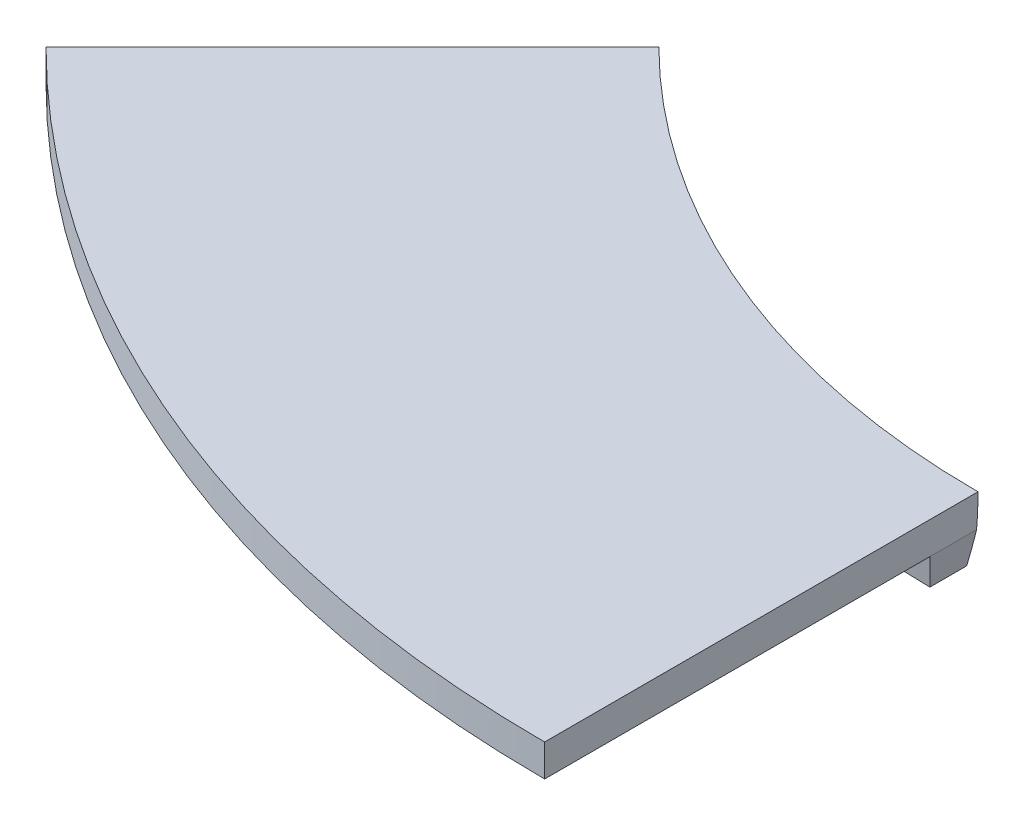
from build123d import *

# Parameters (mm, degrees)
BOSS_EXTRUDE1_DEPTH = 100
BOSS_EXTRUDE2_DEPTH = 100
BOSS_EXTRUDE2_DRAFT = 10
FILLET1_R           = 1140


with BuildPart() as part:
    # Sketch1 → Boss-Extrude1 (new body)
    with BuildSketch(Plane(origin=(0, 0, 0), x_dir=(1, 0, 0), z_dir=(0, 1, 0))):
        with BuildLine():
            Line((0, -3750), (0, -2400))
            ThreePointArc((0, -2400), (-918.440237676, -2217.310878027), (-1697.056274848, -1697.056274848))
            Line((-1697.056274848, -1697.056274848), (-2651.65042945, -2651.65042945))
            ThreePointArc((-2651.65042945, -2651.65042945), (-1435.062871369, -3464.548246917), (0, -3750))
        make_face()
    extrude(amount=BOSS_EXTRUDE1_DEPTH)


with BuildPart() as boss_extrude2_tool:
    # Sketch2 → Boss-Extrude2 (with draft: the straight prism first)
    with BuildSketch(Plane.XZ):
        with BuildLine():
            ThreePointArc((0, 2550), (-975.842752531, 2355.892807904), (-1803.122292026, 1803.122292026))
            Line((-1803.122292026, 1803.122292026), (-1697.056274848, 1697.056274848))
            ThreePointArc((-1697.056274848, 1697.056274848), (-918.440237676, 2217.310878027), (0, 2400))
            Line((0, 2400), (0, 2550))
        make_face()
    extrude(amount=BOSS_EXTRUDE2_DEPTH)
    # Boss-Extrude2: the draft: its side faces are tilted about the plane it starts from
    boss_extrude2_sides = [boss_extrude2_tool.faces().sort_by_distance(p)[0] for p in [
        (0, -50, 2475),
        (-975.842752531, -50, 2355.892807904),
        (-1750.089283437, -50, 1750.089283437),
        (-918.440237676, -50, 2217.310878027),
    ]]
    draft(boss_extrude2_sides, Plane.XZ, BOSS_EXTRUDE2_DRAFT)


with BuildPart() as part_1:
    add(part.part)

    # Boss-Extrude2: add boss_extrude2_tool
    add(boss_extrude2_tool.part)

    # Fillet1
    fillet1_edges = [part_1.edges().sort_by_distance(p)[0] for p in [
        (-918.440237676, 0, 2217.310878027),
    ]]
    fillet(fillet1_edges, radius=FILLET1_R)


solid = part_1.part
